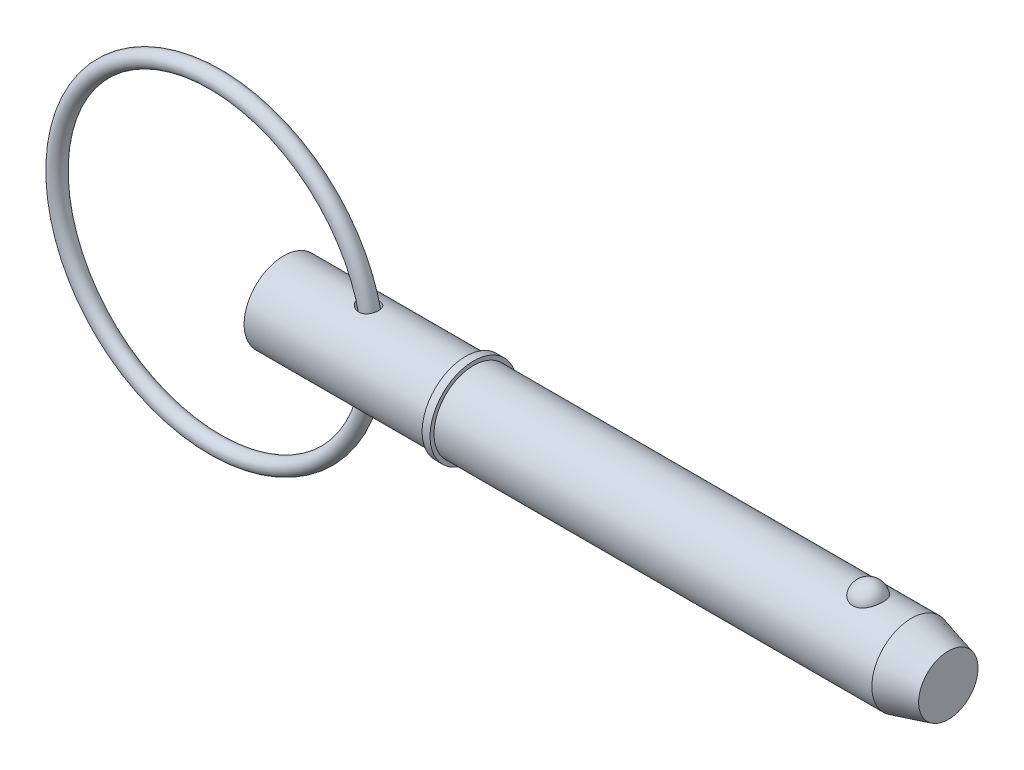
ISO-10303-21;
HEADER;
FILE_DESCRIPTION(('STEP AP214'),'2;1');
FILE_NAME('part.step','',(''),(''),'','','');
FILE_SCHEMA(('AUTOMOTIVE_DESIGN { 1 0 10303 214 1 1 1 1 }'));
ENDSEC;
DATA;
#1=APPLICATION_CONTEXT('core data for automotive mechanical design processes');
#2=APPLICATION_PROTOCOL_DEFINITION('international standard','automotive_design',2000,#1);
#3=PRODUCT_CONTEXT('',#1,'mechanical');
#4=PRODUCT('Part','Part','',(#3));
#5=PRODUCT_RELATED_PRODUCT_CATEGORY('part','',(#4));
#6=PRODUCT_DEFINITION_FORMATION('','',#4);
#7=PRODUCT_DEFINITION_CONTEXT('part definition',#1,'design');
#8=PRODUCT_DEFINITION('design','',#6,#7);
#9=PRODUCT_DEFINITION_SHAPE('','',#8);
#10=(LENGTH_UNIT() NAMED_UNIT(*) SI_UNIT(.MILLI.,.METRE.));
#11=(NAMED_UNIT(*) PLANE_ANGLE_UNIT() SI_UNIT($,.RADIAN.));
#12=(NAMED_UNIT(*) SI_UNIT($,.STERADIAN.) SOLID_ANGLE_UNIT());
#13=UNCERTAINTY_MEASURE_WITH_UNIT(LENGTH_MEASURE(1.E-05),#10,'distance_accuracy_value','');
#14=(GEOMETRIC_REPRESENTATION_CONTEXT(3) GLOBAL_UNCERTAINTY_ASSIGNED_CONTEXT((#13)) GLOBAL_UNIT_ASSIGNED_CONTEXT((#10,
#11,#12)) REPRESENTATION_CONTEXT('',''));
#15=CARTESIAN_POINT('',(0.,0.,0.));
#16=DIRECTION('',(0.,0.,1.));
#17=DIRECTION('',(1.,0.,0.));
#18=AXIS2_PLACEMENT_3D('',#15,#16,#17);
#19=CARTESIAN_POINT('',(-6.86864682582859,0.,0.));
#20=DIRECTION('',(0.,0.,1.));
#21=DIRECTION('',(1.,0.,0.));
#22=AXIS2_PLACEMENT_3D('',#19,#20,#21);
#23=TOROIDAL_SURFACE('',#22,15.875,0.794);
#24=CARTESIAN_POINT('',(9.80035317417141,0.,0.));
#25=VERTEX_POINT('',#24);
#26=VERTEX_LOOP('',#25);
#27=FACE_BOUND('',#26,.T.);
#28=ADVANCED_FACE('P0_F12',(#27),#23,.T.);
#29=CLOSED_SHELL('',(#28));
#30=MANIFOLD_SOLID_BREP('P0_B1',#29);
#31=CARTESIAN_POINT('',(0.,0.,0.));
#32=DIRECTION('',(1.,0.,0.));
#33=DIRECTION('',(0.,0.,-1.));
#34=AXIS2_PLACEMENT_3D('',#31,#32,#33);
#35=CYLINDRICAL_SURFACE('',#34,3.97);
#36=CARTESIAN_POINT('',(7.49679817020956,3.96502331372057,-0.198721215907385));
#37=CARTESIAN_POINT('',(7.50881508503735,3.96235594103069,-0.251916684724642));
#38=CARTESIAN_POINT('',(7.52561550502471,3.95866151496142,-0.304017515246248));
#39=CARTESIAN_POINT('',(7.56786984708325,3.9496659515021,-0.40447153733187));
#40=CARTESIAN_POINT('',(7.59333797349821,3.94436217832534,-0.452818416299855));
#41=CARTESIAN_POINT('',(7.65162192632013,3.93277091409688,-0.544364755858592));
#42=CARTESIAN_POINT('',(7.68440149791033,3.92648832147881,-0.587588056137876));
#43=CARTESIAN_POINT('',(7.75622109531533,3.91354812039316,-0.668369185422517));
#44=CARTESIAN_POINT('',(7.79526077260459,3.90689053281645,-0.705927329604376));
#45=CARTESIAN_POINT('',(7.88192852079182,3.8932854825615,-0.777603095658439));
#46=CARTESIAN_POINT('',(7.92999678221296,3.88635845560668,-0.811192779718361));
#47=CARTESIAN_POINT('',(8.03094744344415,3.87352417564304,-0.870420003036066));
#48=CARTESIAN_POINT('',(8.08383192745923,3.86761736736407,-0.896054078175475));
#49=CARTESIAN_POINT('',(8.19632733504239,3.85719062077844,-0.939958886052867));
#50=CARTESIAN_POINT('',(8.25615064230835,3.85277154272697,-0.957713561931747));
#51=CARTESIAN_POINT('',(8.37807849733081,3.84644428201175,-0.982821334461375));
#52=CARTESIAN_POINT('',(8.44018249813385,3.84453550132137,-0.990176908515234));
#53=CARTESIAN_POINT('',(8.56256649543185,3.84359535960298,-0.993820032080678));
#54=CARTESIAN_POINT('',(8.62283390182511,3.84446524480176,-0.990487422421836));
#55=CARTESIAN_POINT('',(8.74175397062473,3.84884648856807,-0.973323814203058));
#56=CARTESIAN_POINT('',(8.8004073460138,3.85235666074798,-0.959497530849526));
#57=CARTESIAN_POINT('',(8.91034168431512,3.86130428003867,-0.922798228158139));
#58=CARTESIAN_POINT('',(8.96185380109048,3.86659969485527,-0.900580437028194));
#59=CARTESIAN_POINT('',(9.06016940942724,3.87853590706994,-0.847697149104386));
#60=CARTESIAN_POINT('',(9.10697344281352,3.88517654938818,-0.817032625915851));
#61=CARTESIAN_POINT('',(9.19340982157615,3.89885483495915,-0.748999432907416));
#62=CARTESIAN_POINT('',(9.23319345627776,3.90587821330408,-0.711819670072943));
#63=CARTESIAN_POINT('',(9.30598310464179,3.91969783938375,-0.631295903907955));
#64=CARTESIAN_POINT('',(9.33898892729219,3.92649408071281,-0.587951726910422));
#65=CARTESIAN_POINT('',(9.39769437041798,3.939185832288,-0.495874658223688));
#66=CARTESIAN_POINT('',(9.42332322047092,3.94507238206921,-0.447095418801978));
#67=CARTESIAN_POINT('',(9.46625710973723,3.9552342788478,-0.345845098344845));
#68=CARTESIAN_POINT('',(9.48356178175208,3.95950955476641,-0.293373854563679));
#69=CARTESIAN_POINT('',(9.50956700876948,3.96602451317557,-0.185698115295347));
#70=CARTESIAN_POINT('',(9.51818595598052,3.96824487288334,-0.13047272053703));
#71=CARTESIAN_POINT('',(9.52633336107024,3.97034220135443,-0.0193113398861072));
#72=CARTESIAN_POINT('',(9.52586171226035,3.97021914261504,0.0366246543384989));
#73=CARTESIAN_POINT('',(9.51583327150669,3.9676413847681,0.147685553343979));
#74=CARTESIAN_POINT('',(9.50626624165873,3.96518405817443,0.202809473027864));
#75=CARTESIAN_POINT('',(9.47825604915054,3.95819854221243,0.310618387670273));
#76=CARTESIAN_POINT('',(9.45981267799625,3.95367030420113,0.36330332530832));
#77=CARTESIAN_POINT('',(9.41448405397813,3.94303435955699,0.464739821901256));
#78=CARTESIAN_POINT('',(9.38759833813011,3.93692656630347,0.51349116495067));
#79=CARTESIAN_POINT('',(9.32603556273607,3.92380455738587,0.605663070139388));
#80=CARTESIAN_POINT('',(9.29135869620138,3.91679036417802,0.649083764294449));
#81=CARTESIAN_POINT('',(9.21526329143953,3.90267522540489,0.729160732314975));
#82=CARTESIAN_POINT('',(9.17387556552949,3.89557480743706,0.765846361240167));
#83=CARTESIAN_POINT('',(9.08536362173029,3.88206315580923,0.831635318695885));
#84=CARTESIAN_POINT('',(9.03824022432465,3.8756518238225,0.860739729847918));
#85=CARTESIAN_POINT('',(8.94022154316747,3.86431915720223,0.910262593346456));
#86=CARTESIAN_POINT('',(8.88938101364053,3.85938013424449,0.930785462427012));
#87=CARTESIAN_POINT('',(8.78488780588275,3.85141510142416,0.96321476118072));
#88=CARTESIAN_POINT('',(8.73123520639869,3.84838903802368,0.975121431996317));
#89=CARTESIAN_POINT('',(8.62249427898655,3.84453017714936,0.990226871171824));
#90=CARTESIAN_POINT('',(8.56740225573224,3.84370373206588,0.993400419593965));
#91=CARTESIAN_POINT('',(8.45741104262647,3.8442816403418,0.991160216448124));
#92=CARTESIAN_POINT('',(8.40251189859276,3.84568649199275,0.98574454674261));
#93=CARTESIAN_POINT('',(8.29176880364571,3.85062289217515,0.966285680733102));
#94=CARTESIAN_POINT('',(8.23599684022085,3.85424894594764,0.951858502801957));
#95=CARTESIAN_POINT('',(8.12747212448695,3.86325492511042,0.91461785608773));
#96=CARTESIAN_POINT('',(8.0747205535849,3.86863553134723,0.891801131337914));
#97=CARTESIAN_POINT('',(7.97015235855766,3.88095261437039,0.836633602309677));
#98=CARTESIAN_POINT('',(7.91862083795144,3.88796764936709,0.803758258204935));
#99=CARTESIAN_POINT('',(7.82179253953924,3.90250904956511,0.729888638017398));
#100=CARTESIAN_POINT('',(7.77649765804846,3.91003556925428,0.688891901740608));
#101=CARTESIAN_POINT('',(7.69332536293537,3.92478114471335,0.599225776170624));
#102=CARTESIAN_POINT('',(7.6555122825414,3.93199714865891,0.550495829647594));
#103=CARTESIAN_POINT('',(7.5894819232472,3.94512912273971,0.446741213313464));
#104=CARTESIAN_POINT('',(7.56125849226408,3.95104592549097,0.391720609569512));
#105=CARTESIAN_POINT('',(7.51806227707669,3.9603062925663,0.282172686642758));
#106=CARTESIAN_POINT('',(7.50213211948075,3.96383230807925,0.228039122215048));
#107=CARTESIAN_POINT('',(7.48057398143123,3.96863642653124,0.117706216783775));
#108=CARTESIAN_POINT('',(7.47492746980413,3.96991857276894,0.0615107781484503));
#109=CARTESIAN_POINT('',(7.47437932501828,3.97004395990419,-0.0289758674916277));
#110=CARTESIAN_POINT('',(7.47615129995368,3.96964216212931,-0.0632805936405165));
#111=CARTESIAN_POINT('',(7.48358566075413,3.96796978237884,-0.131441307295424));
#112=CARTESIAN_POINT('',(7.48924767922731,3.96669928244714,-0.165297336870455));
#113=CARTESIAN_POINT('',(7.49679817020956,3.96502331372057,-0.198721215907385));
#114=B_SPLINE_CURVE_WITH_KNOTS('',3,(#36,#37,#38,#39,#40,#41,#42,#43,#44,#45,#46,#47,#48,#49,
#50,#51,#52,#53,#54,#55,#56,#57,#58,#59,#60,#61,#62,#63,#64,#65,#66,#67,#68,#69,#70,#71,#72,#73,
#74,#75,#76,#77,#78,#79,#80,#81,#82,#83,#84,#85,#86,#87,#88,#89,#90,#91,#92,#93,#94,#95,#96,#97,
#98,#99,#100,#101,#102,#103,#104,#105,#106,#107,#108,#109,#110,#111,#112,#113),.UNSPECIFIED.,
.T.,.F.,(4,2,2,2,2,2,2,2,2,2,2,2,2,2,2,2,2,2,2,2,2,2,2,2,2,2,2,2,2,2,2,2,2,2,2,2,2,2,4),(0.,
0.163661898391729,0.327593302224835,0.490729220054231,0.653856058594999,0.830244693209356,
1.00671002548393,1.1934572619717,1.38016000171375,1.56030212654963,1.74036335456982,
1.90857505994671,2.07676738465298,2.24071128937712,2.40465981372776,2.57013239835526,
2.73561228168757,2.90263284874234,3.06965537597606,3.23686612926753,3.40408081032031,
3.5713046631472,3.73852437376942,3.90499698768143,4.07144581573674,4.2358058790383,
4.40016134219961,4.56499094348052,4.72985735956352,4.90227873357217,5.0747670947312,
5.25849939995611,5.44228744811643,5.62759301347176,5.81277947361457,5.98144776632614,
6.14981181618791,6.25265388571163,6.35548624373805),.UNSPECIFIED.);
#115=CARTESIAN_POINT('',(7.49679817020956,3.96502331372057,-0.198721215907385));
#116=VERTEX_POINT('',#115);
#117=EDGE_CURVE('P1_E42',#116,#116,#114,.T.);
#118=ORIENTED_EDGE('',*,*,#117,.T.);
#119=EDGE_LOOP('',(#118));
#120=FACE_BOUND('',#119,.T.);
#121=CARTESIAN_POINT('',(0.,0.,0.));
#122=DIRECTION('',(1.,0.,0.));
#123=DIRECTION('',(0.,0.,-1.));
#124=AXIS2_PLACEMENT_3D('',#121,#122,#123);
#125=CIRCLE('',#124,3.97);
#126=CARTESIAN_POINT('',(0.,0.,-3.97));
#127=VERTEX_POINT('',#126);
#128=EDGE_CURVE('P1_E9',#127,#127,#125,.T.);
#129=ORIENTED_EDGE('',*,*,#128,.T.);
#130=EDGE_LOOP('',(#129));
#131=FACE_BOUND('',#130,.T.);
#132=CARTESIAN_POINT('',(18.256,0.,0.));
#133=DIRECTION('',(1.,0.,0.));
#134=DIRECTION('',(0.,0.,-1.));
#135=AXIS2_PLACEMENT_3D('',#132,#133,#134);
#136=CIRCLE('',#135,3.97);
#137=CARTESIAN_POINT('',(18.256,0.,-3.97));
#138=VERTEX_POINT('',#137);
#139=EDGE_CURVE('P1_E25',#138,#138,#136,.T.);
#140=ORIENTED_EDGE('',*,*,#139,.F.);
#141=EDGE_LOOP('',(#140));
#142=FACE_BOUND('',#141,.T.);
#143=CARTESIAN_POINT('',(7.49679817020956,-3.96502331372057,-0.198721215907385));
#144=CARTESIAN_POINT('',(7.48580986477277,-3.96746179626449,-0.150065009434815));
#145=CARTESIAN_POINT('',(7.47881617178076,-3.96904213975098,-0.100459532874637));
#146=CARTESIAN_POINT('',(7.47318383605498,-3.97031279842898,-0.000748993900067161));
#147=CARTESIAN_POINT('',(7.47454464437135,-3.97000323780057,0.049356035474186));
#148=CARTESIAN_POINT('',(7.48554252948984,-3.9675299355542,0.148550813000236));
#149=CARTESIAN_POINT('',(7.49517270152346,-3.9653677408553,0.197641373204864));
#150=CARTESIAN_POINT('',(7.5222068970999,-3.95942609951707,0.293523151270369));
#151=CARTESIAN_POINT('',(7.53961293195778,-3.9556462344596,0.340313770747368));
#152=CARTESIAN_POINT('',(7.58186218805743,-3.946757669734,0.431446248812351));
#153=CARTESIAN_POINT('',(7.6068526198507,-3.94162295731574,0.475716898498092));
#154=CARTESIAN_POINT('',(7.66318857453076,-3.93055115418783,0.559886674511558));
#155=CARTESIAN_POINT('',(7.69453617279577,-3.92461380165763,0.599784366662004));
#156=CARTESIAN_POINT('',(7.76618955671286,-3.91181958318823,0.678467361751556));
#157=CARTESIAN_POINT('',(7.80708710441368,-3.90493119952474,0.716708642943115));
#158=CARTESIAN_POINT('',(7.89431870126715,-3.89148185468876,0.786469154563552));
#159=CARTESIAN_POINT('',(7.94065563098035,-3.88492106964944,0.817984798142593));
#160=CARTESIAN_POINT('',(8.04208221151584,-3.87221514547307,0.876253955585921));
#161=CARTESIAN_POINT('',(8.09758465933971,-3.8661622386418,0.902312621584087));
#162=CARTESIAN_POINT('',(8.21228401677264,-3.855952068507,0.944996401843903));
#163=CARTESIAN_POINT('',(8.27148128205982,-3.85179498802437,0.961620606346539));
#164=CARTESIAN_POINT('',(8.39228716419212,-3.84593851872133,0.984786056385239));
#165=CARTESIAN_POINT('',(8.45390693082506,-3.84425231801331,0.991273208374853));
#166=CARTESIAN_POINT('',(8.57734686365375,-3.84370168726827,0.993408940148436));
#167=CARTESIAN_POINT('',(8.63916691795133,-3.84483588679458,0.989062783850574));
#168=CARTESIAN_POINT('',(8.75703619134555,-3.84970227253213,0.969937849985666));
#169=CARTESIAN_POINT('',(8.81320274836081,-3.85326512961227,0.955838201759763));
#170=CARTESIAN_POINT('',(8.92207486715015,-3.8624204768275,0.918140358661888));
#171=CARTESIAN_POINT('',(8.97478130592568,-3.86801245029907,0.89454458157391));
#172=CARTESIAN_POINT('',(9.07264210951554,-3.88024902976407,0.83982747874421));
#173=CARTESIAN_POINT('',(9.11803751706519,-3.88683023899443,0.809121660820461));
#174=CARTESIAN_POINT('',(9.20292513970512,-3.90048324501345,0.740506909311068));
#175=CARTESIAN_POINT('',(9.24241747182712,-3.90755503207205,0.702598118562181));
#176=CARTESIAN_POINT('',(9.31440361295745,-3.92139192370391,0.620727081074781));
#177=CARTESIAN_POINT('',(9.34691105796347,-3.9281576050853,0.576776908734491));
#178=CARTESIAN_POINT('',(9.40424150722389,-3.94066521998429,0.483990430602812));
#179=CARTESIAN_POINT('',(9.4290641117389,-3.94640710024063,0.435153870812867));
#180=CARTESIAN_POINT('',(9.47070060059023,-3.95631713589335,0.333318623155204));
#181=CARTESIAN_POINT('',(9.48741220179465,-3.96046506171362,0.280276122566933));
#182=CARTESIAN_POINT('',(9.51197570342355,-3.9666399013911,0.172058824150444));
#183=CARTESIAN_POINT('',(9.5198274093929,-3.96866676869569,0.116883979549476));
#184=CARTESIAN_POINT('',(9.52650209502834,-3.9703865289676,0.00572427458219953));
#185=CARTESIAN_POINT('',(9.52528754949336,-3.97006972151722,-0.0502629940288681));
#186=CARTESIAN_POINT('',(9.51376883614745,-3.96711300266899,-0.161232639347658));
#187=CARTESIAN_POINT('',(9.50346452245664,-3.96447305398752,-0.216214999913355));
#188=CARTESIAN_POINT('',(9.47400716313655,-3.95715440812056,-0.323616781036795));
#189=CARTESIAN_POINT('',(9.45485370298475,-3.95247561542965,-0.376036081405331));
#190=CARTESIAN_POINT('',(9.40815019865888,-3.94158766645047,-0.47682082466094));
#191=CARTESIAN_POINT('',(9.38060003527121,-3.93537848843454,-0.525186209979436));
#192=CARTESIAN_POINT('',(9.31780916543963,-3.92212278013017,-0.616423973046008));
#193=CARTESIAN_POINT('',(9.28257772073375,-3.91507726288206,-0.659302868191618));
#194=CARTESIAN_POINT('',(9.20530256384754,-3.90093459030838,-0.738394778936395));
#195=CARTESIAN_POINT('',(9.16325952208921,-3.8938374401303,-0.774608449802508));
#196=CARTESIAN_POINT('',(9.07394283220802,-3.88046830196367,-0.83901178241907));
#197=CARTESIAN_POINT('',(9.02672460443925,-3.87418889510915,-0.867276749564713));
#198=CARTESIAN_POINT('',(8.92806876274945,-3.86308015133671,-0.915492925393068));
#199=CARTESIAN_POINT('',(8.87663164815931,-3.85825064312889,-0.935445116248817));
#200=CARTESIAN_POINT('',(8.77150354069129,-3.85059630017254,-0.966469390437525));
#201=CARTESIAN_POINT('',(8.71783614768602,-3.84775433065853,-0.977617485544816));
#202=CARTESIAN_POINT('',(8.60934883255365,-3.84426767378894,-0.991239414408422));
#203=CARTESIAN_POINT('',(8.55452877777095,-3.84362324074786,-0.993712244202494));
#204=CARTESIAN_POINT('',(8.4438244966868,-3.84454392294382,-0.990144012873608));
#205=CARTESIAN_POINT('',(8.3879479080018,-3.84616465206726,-0.983888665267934));
#206=CARTESIAN_POINT('',(8.27791058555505,-3.85146784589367,-0.962917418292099));
#207=CARTESIAN_POINT('',(8.22375037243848,-3.85515092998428,-0.948198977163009));
#208=CARTESIAN_POINT('',(8.11503410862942,-3.86443542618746,-0.90964598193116));
#209=CARTESIAN_POINT('',(8.06067129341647,-3.87014379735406,-0.885291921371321));
#210=CARTESIAN_POINT('',(7.95661263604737,-3.88274545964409,-0.828274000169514));
#211=CARTESIAN_POINT('',(7.90691941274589,-3.88963940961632,-0.795605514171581));
#212=CARTESIAN_POINT('',(7.81143608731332,-3.90417480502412,-0.720990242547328));
#213=CARTESIAN_POINT('',(7.76592225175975,-3.9118359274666,-0.678692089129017));
#214=CARTESIAN_POINT('',(7.68309200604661,-3.926691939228,-0.586646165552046));
#215=CARTESIAN_POINT('',(7.6457689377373,-3.93388720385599,-0.536904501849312));
#216=CARTESIAN_POINT('',(7.58649683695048,-3.94577687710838,-0.440118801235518));
#217=CARTESIAN_POINT('',(7.56301593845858,-3.95068841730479,-0.394037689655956));
#218=CARTESIAN_POINT('',(7.52386335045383,-3.95904753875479,-0.298549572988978));
#219=CARTESIAN_POINT('',(7.5081856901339,-3.96249623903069,-0.249145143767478));
#220=CARTESIAN_POINT('',(7.49679817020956,-3.96502331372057,-0.198721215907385));
#221=B_SPLINE_CURVE_WITH_KNOTS('',3,(#143,#144,#145,#146,#147,#148,#149,#150,#151,#152,#153,
#154,#155,#156,#157,#158,#159,#160,#161,#162,#163,#164,#165,#166,#167,#168,#169,#170,#171,#172,
#173,#174,#175,#176,#177,#178,#179,#180,#181,#182,#183,#184,#185,#186,#187,#188,#189,#190,#191,
#192,#193,#194,#195,#196,#197,#198,#199,#200,#201,#202,#203,#204,#205,#206,#207,#208,#209,#210,
#211,#212,#213,#214,#215,#216,#217,#218,#219,#220),.UNSPECIFIED.,.T.,.F.,(4,2,2,2,2,2,2,2,2,2,2,
2,2,2,2,2,2,2,2,2,2,2,2,2,2,2,2,2,2,2,2,2,2,2,2,2,2,2,4),(0.,0.149644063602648,
0.299278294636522,0.448787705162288,0.598335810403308,0.750995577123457,0.903705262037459,
1.07224475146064,1.2408739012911,1.4248565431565,1.60885692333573,1.79383585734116,
1.97872492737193,2.15188813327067,2.32500727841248,2.489818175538,2.65462580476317,
2.81910871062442,2.98360017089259,3.15011526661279,3.31663401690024,3.48384236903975,
3.65105340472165,3.81827227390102,3.98549351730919,4.15251423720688,4.31951852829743,
4.48488279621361,4.65022752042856,4.81412860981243,4.97804866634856,5.14606470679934,
5.31413123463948,5.49286956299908,5.67170754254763,5.85859317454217,6.0453263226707,
6.20052601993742,6.35560677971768),.UNSPECIFIED.);
#222=CARTESIAN_POINT('',(7.49679817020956,-3.96502331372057,-0.198721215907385));
#223=VERTEX_POINT('',#222);
#224=EDGE_CURVE('P1_E17',#223,#223,#221,.T.);
#225=ORIENTED_EDGE('',*,*,#224,.T.);
#226=EDGE_LOOP('',(#225));
#227=FACE_BOUND('',#226,.T.);
#228=ADVANCED_FACE('P1_F13',(#120,#131,#142,#227),#35,.T.);
#229=CARTESIAN_POINT('',(0.,0.,0.));
#230=DIRECTION('',(1.,0.,0.));
#231=DIRECTION('',(0.,0.,-1.));
#232=AXIS2_PLACEMENT_3D('',#229,#230,#231);
#233=CYLINDRICAL_SURFACE('',#232,3.97);
#234=CARTESIAN_POINT('',(62.9759395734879,0.,0.));
#235=DIRECTION('',(1.,0.,0.));
#236=DIRECTION('',(0.,0.,-1.));
#237=AXIS2_PLACEMENT_3D('',#234,#235,#236);
#238=CIRCLE('',#237,3.97);
#239=CARTESIAN_POINT('',(62.9759395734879,0.,-3.97));
#240=VERTEX_POINT('',#239);
#241=EDGE_CURVE('P1_E99',#240,#240,#238,.T.);
#242=ORIENTED_EDGE('',*,*,#241,.F.);
#243=EDGE_LOOP('',(#242));
#244=FACE_BOUND('',#243,.T.);
#245=CARTESIAN_POINT('',(19.05,0.,0.));
#246=DIRECTION('',(1.,0.,0.));
#247=DIRECTION('',(0.,0.,-1.));
#248=AXIS2_PLACEMENT_3D('',#245,#246,#247);
#249=CIRCLE('',#248,3.97);
#250=CARTESIAN_POINT('',(19.05,0.,-3.97));
#251=VERTEX_POINT('',#250);
#252=EDGE_CURVE('P1_E96',#251,#251,#249,.T.);
#253=ORIENTED_EDGE('',*,*,#252,.T.);
#254=EDGE_LOOP('',(#253));
#255=FACE_BOUND('',#254,.T.);
#256=CARTESIAN_POINT('',(58.6451922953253,3.65715365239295,1.5447094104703));
#257=CARTESIAN_POINT('',(58.5652448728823,3.65716001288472,1.54470290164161));
#258=CARTESIAN_POINT('',(58.4851650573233,3.65987074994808,1.53832549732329));
#259=CARTESIAN_POINT('',(58.3272374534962,3.6704221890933,1.51297018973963));
#260=CARTESIAN_POINT('',(58.2493961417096,3.67827646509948,1.49395894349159));
#261=CARTESIAN_POINT('',(58.0984614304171,3.69818848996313,1.4439595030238));
#262=CARTESIAN_POINT('',(58.0253560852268,3.71023513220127,1.41300293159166));
#263=CARTESIAN_POINT('',(57.8855630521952,3.7372183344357,1.34000212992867));
#264=CARTESIAN_POINT('',(57.8188725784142,3.75215363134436,1.29796274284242));
#265=CARTESIAN_POINT('',(57.69148864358,3.78384968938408,1.20248834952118));
#266=CARTESIAN_POINT('',(57.6310299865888,3.800651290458,1.14875388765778));
#267=CARTESIAN_POINT('',(57.5196942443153,3.83398532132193,1.03205417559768));
#268=CARTESIAN_POINT('',(57.4688200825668,3.85051766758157,0.96908611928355));
#269=CARTESIAN_POINT('',(57.3756321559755,3.88238608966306,0.832526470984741));
#270=CARTESIAN_POINT('',(57.3337961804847,3.89763698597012,0.758588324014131));
#271=CARTESIAN_POINT('',(57.2625108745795,3.92451063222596,0.604352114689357));
#272=CARTESIAN_POINT('',(57.2330623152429,3.93613315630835,0.524053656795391));
#273=CARTESIAN_POINT('',(57.1868927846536,3.95467606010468,0.358403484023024));
#274=CARTESIAN_POINT('',(57.1703127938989,3.96154426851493,0.273006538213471));
#275=CARTESIAN_POINT('',(57.150756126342,3.96967008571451,0.100408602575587));
#276=CARTESIAN_POINT('',(57.1477789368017,3.97092790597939,0.0132076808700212));
#277=CARTESIAN_POINT('',(57.1554587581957,3.96771794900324,-0.15984454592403));
#278=CARTESIAN_POINT('',(57.1660164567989,3.96329187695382,-0.245701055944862));
#279=CARTESIAN_POINT('',(57.2003800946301,3.94923163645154,-0.414277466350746));
#280=CARTESIAN_POINT('',(57.2241862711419,3.93959737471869,-0.49699731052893));
#281=CARTESIAN_POINT('',(57.2846114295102,3.91607752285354,-0.657113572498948));
#282=CARTESIAN_POINT('',(57.3212495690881,3.90218558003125,-0.734501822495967));
#283=CARTESIAN_POINT('',(57.4065935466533,3.87158287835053,-0.881704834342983));
#284=CARTESIAN_POINT('',(57.4553004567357,3.8548718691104,-0.951518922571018));
#285=CARTESIAN_POINT('',(57.5641161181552,3.82028735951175,-1.08208159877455));
#286=CARTESIAN_POINT('',(57.6242955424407,3.80240713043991,-1.14276958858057));
#287=CARTESIAN_POINT('',(57.754493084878,3.76758161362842,-1.25282437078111));
#288=CARTESIAN_POINT('',(57.8245105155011,3.75063626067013,-1.30219195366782));
#289=CARTESIAN_POINT('',(57.97118160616,3.71998948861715,-1.38729709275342));
#290=CARTESIAN_POINT('',(58.0476813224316,3.70623183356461,-1.42327904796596));
#291=CARTESIAN_POINT('',(58.2062981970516,3.68323188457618,-1.48178996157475));
#292=CARTESIAN_POINT('',(58.2884132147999,3.67398788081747,-1.50432401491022));
#293=CARTESIAN_POINT('',(58.4514810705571,3.6615216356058,-1.53440939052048));
#294=CARTESIAN_POINT('',(58.5322840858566,3.65801951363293,-1.54265826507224));
#295=CARTESIAN_POINT('',(58.6942085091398,3.65657341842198,-1.54608423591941));
#296=CARTESIAN_POINT('',(58.7753298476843,3.65862829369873,-1.5412640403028));
#297=CARTESIAN_POINT('',(58.9328122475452,3.66788969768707,-1.51908474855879));
#298=CARTESIAN_POINT('',(59.0092422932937,3.67492621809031,-1.50213925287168));
#299=CARTESIAN_POINT('',(59.1580412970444,3.69318404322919,-1.4566698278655));
#300=CARTESIAN_POINT('',(59.2304099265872,3.7044056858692,-1.42814496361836));
#301=CARTESIAN_POINT('',(59.3708029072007,3.73012749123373,-1.35956319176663));
#302=CARTESIAN_POINT('',(59.4387000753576,3.74469307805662,-1.31927107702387));
#303=CARTESIAN_POINT('',(59.5668649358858,3.77545272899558,-1.22847440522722));
#304=CARTESIAN_POINT('',(59.6271308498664,3.79164717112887,-1.17796747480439));
#305=CARTESIAN_POINT('',(59.7416346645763,3.82490325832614,-1.0651926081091));
#306=CARTESIAN_POINT('',(59.7954137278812,3.84196735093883,-1.0024591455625));
#307=CARTESIAN_POINT('',(59.8920988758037,3.87439863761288,-0.868715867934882));
#308=CARTESIAN_POINT('',(59.9350030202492,3.88976552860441,-0.797704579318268));
#309=CARTESIAN_POINT('',(60.010266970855,3.91771381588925,-0.646896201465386));
#310=CARTESIAN_POINT('',(60.0422532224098,3.93019255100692,-0.566893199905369));
#311=CARTESIAN_POINT('',(60.0931101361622,3.95043886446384,-0.4022551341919));
#312=CARTESIAN_POINT('',(60.1119807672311,3.95820643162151,-0.317620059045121));
#313=CARTESIAN_POINT('',(60.1362162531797,3.96823733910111,-0.146156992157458));
#314=CARTESIAN_POINT('',(60.1415874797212,3.97050327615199,-0.0593300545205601));
#315=CARTESIAN_POINT('',(60.138730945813,3.96930811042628,0.114057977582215));
#316=CARTESIAN_POINT('',(60.1305035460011,3.9658471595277,0.200619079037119));
#317=CARTESIAN_POINT('',(60.1007063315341,3.95358562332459,0.370506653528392));
#318=CARTESIAN_POINT('',(60.0792129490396,3.94481563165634,0.45384877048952));
#319=CARTESIAN_POINT('',(60.0233839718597,3.92284586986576,0.615497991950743));
#320=CARTESIAN_POINT('',(59.9890474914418,3.90964579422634,0.693804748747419));
#321=CARTESIAN_POINT('',(59.9079702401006,3.88006987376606,0.843703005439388));
#322=CARTESIAN_POINT('',(59.8611536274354,3.86367478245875,0.915249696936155));
#323=CARTESIAN_POINT('',(59.7561897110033,3.82949741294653,1.04910810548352));
#324=CARTESIAN_POINT('',(59.6980428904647,3.81171519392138,1.1114202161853));
#325=CARTESIAN_POINT('',(59.5717433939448,3.77673366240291,1.22503948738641));
#326=CARTESIAN_POINT('',(59.5035970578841,3.75953398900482,1.27635357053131));
#327=CARTESIAN_POINT('',(59.3589009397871,3.72770506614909,1.36653336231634));
#328=CARTESIAN_POINT('',(59.282348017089,3.7130767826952,1.40539439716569));
#329=CARTESIAN_POINT('',(59.1257594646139,3.68864287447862,1.46830480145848));
#330=CARTESIAN_POINT('',(59.0459307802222,3.67869017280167,1.49281289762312));
#331=CARTESIAN_POINT('',(58.8829877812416,3.66414535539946,1.52817474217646));
#332=CARTESIAN_POINT('',(58.7998840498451,3.65953723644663,1.53906926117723));
#333=CARTESIAN_POINT('',(58.6927760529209,3.6573894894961,1.54414878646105));
#334=CARTESIAN_POINT('',(58.6689900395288,3.65715175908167,1.54471134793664));
#335=CARTESIAN_POINT('',(58.6451922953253,3.65715365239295,1.5447094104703));
#336=B_SPLINE_CURVE_WITH_KNOTS('',3,(#256,#257,#258,#259,#260,#261,#262,#263,#264,#265,#266,
#267,#268,#269,#270,#271,#272,#273,#274,#275,#276,#277,#278,#279,#280,#281,#282,#283,#284,#285,
#286,#287,#288,#289,#290,#291,#292,#293,#294,#295,#296,#297,#298,#299,#300,#301,#302,#303,#304,
#305,#306,#307,#308,#309,#310,#311,#312,#313,#314,#315,#316,#317,#318,#319,#320,#321,#322,#323,
#324,#325,#326,#327,#328,#329,#330,#331,#332,#333,#334,#335),.UNSPECIFIED.,.T.,.F.,(4,2,2,2,2,2,
2,2,2,2,2,2,2,2,2,2,2,2,2,2,2,2,2,2,2,2,2,2,2,2,2,2,2,2,2,2,2,2,2,4),(0.,0.239777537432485,
0.480190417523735,0.719971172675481,0.959647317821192,1.20639040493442,1.45320863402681,
1.71093679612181,1.9686809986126,2.22921052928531,2.48973023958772,2.74834928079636,
3.00697295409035,3.26598440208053,3.52501886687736,3.78570385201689,4.04637062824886,
4.30201257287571,4.55755760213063,4.80022994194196,5.04285200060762,5.27757006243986,
5.51230707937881,5.75210128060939,5.99195126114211,6.24392810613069,6.49594987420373,
6.7558881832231,7.01582710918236,7.27564332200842,7.53545264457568,7.79377886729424,
8.05212290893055,8.3120741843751,8.57201437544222,8.83179046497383,9.09166393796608,
9.34270057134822,9.59298357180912,9.66435753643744),.UNSPECIFIED.);
#337=CARTESIAN_POINT('',(58.6451922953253,3.65715365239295,1.5447094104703));
#338=VERTEX_POINT('',#337);
#339=EDGE_CURVE('P1_E34',#338,#338,#336,.T.);
#340=ORIENTED_EDGE('',*,*,#339,.T.);
#341=EDGE_LOOP('',(#340));
#342=FACE_BOUND('',#341,.T.);
#343=ADVANCED_FACE('P1_F46',(#244,#255,#342),#233,.T.);
#344=CARTESIAN_POINT('',(0.,0.,0.));
#345=DIRECTION('',(-1.,0.,0.));
#346=DIRECTION('',(0.,0.,1.));
#347=AXIS2_PLACEMENT_3D('',#344,#345,#346);
#348=PLANE('',#347);
#349=ORIENTED_EDGE('',*,*,#128,.F.);
#350=EDGE_LOOP('',(#349));
#351=FACE_BOUND('',#350,.T.);
#352=ADVANCED_FACE('P1_F15',(#351),#348,.T.);
#353=CARTESIAN_POINT('',(18.256,3.97,0.));
#354=DIRECTION('',(-1.,0.,0.));
#355=DIRECTION('',(0.,0.,1.));
#356=AXIS2_PLACEMENT_3D('',#353,#354,#355);
#357=PLANE('',#356);
#358=ORIENTED_EDGE('',*,*,#139,.T.);
#359=EDGE_LOOP('',(#358));
#360=FACE_BOUND('',#359,.T.);
#361=CARTESIAN_POINT('',(18.256,0.,0.));
#362=DIRECTION('',(1.,0.,0.));
#363=DIRECTION('',(0.,0.,-1.));
#364=AXIS2_PLACEMENT_3D('',#361,#362,#363);
#365=CIRCLE('',#364,4.367);
#366=CARTESIAN_POINT('',(18.256,0.,-4.367));
#367=VERTEX_POINT('',#366);
#368=EDGE_CURVE('P1_E30',#367,#367,#365,.T.);
#369=ORIENTED_EDGE('',*,*,#368,.F.);
#370=EDGE_LOOP('',(#369));
#371=FACE_BOUND('',#370,.T.);
#372=ADVANCED_FACE('P1_F81',(#360,#371),#357,.T.);
#373=CARTESIAN_POINT('',(0.,0.,0.));
#374=DIRECTION('',(1.,0.,0.));
#375=DIRECTION('',(0.,0.,-1.));
#376=AXIS2_PLACEMENT_3D('',#373,#374,#375);
#377=CYLINDRICAL_SURFACE('',#376,4.367);
#378=ORIENTED_EDGE('',*,*,#368,.T.);
#379=EDGE_LOOP('',(#378));
#380=FACE_BOUND('',#379,.T.);
#381=CARTESIAN_POINT('',(19.05,0.,0.));
#382=DIRECTION('',(1.,0.,0.));
#383=DIRECTION('',(0.,0.,-1.));
#384=AXIS2_PLACEMENT_3D('',#381,#382,#383);
#385=CIRCLE('',#384,4.367);
#386=CARTESIAN_POINT('',(19.05,0.,-4.367));
#387=VERTEX_POINT('',#386);
#388=EDGE_CURVE('P1_E95',#387,#387,#385,.T.);
#389=ORIENTED_EDGE('',*,*,#388,.F.);
#390=EDGE_LOOP('',(#389));
#391=FACE_BOUND('',#390,.T.);
#392=ADVANCED_FACE('P1_F68',(#380,#391),#377,.T.);
#393=CARTESIAN_POINT('',(19.05,4.367,0.));
#394=DIRECTION('',(1.,0.,0.));
#395=DIRECTION('',(0.,0.,-1.));
#396=AXIS2_PLACEMENT_3D('',#393,#394,#395);
#397=PLANE('',#396);
#398=ORIENTED_EDGE('',*,*,#388,.T.);
#399=EDGE_LOOP('',(#398));
#400=FACE_BOUND('',#399,.T.);
#401=ORIENTED_EDGE('',*,*,#252,.F.);
#402=EDGE_LOOP('',(#401));
#403=FACE_BOUND('',#402,.T.);
#404=ADVANCED_FACE('P1_F62',(#400,#403),#397,.T.);
#405=CARTESIAN_POINT('',(66.68,0.,0.));
#406=DIRECTION('',(-1.,0.,0.));
#407=DIRECTION('',(0.,0.,1.));
#408=AXIS2_PLACEMENT_3D('',#405,#406,#407);
#409=CONICAL_SURFACE('',#408,2.97750000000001,0.26179938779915);
#410=ORIENTED_EDGE('',*,*,#241,.T.);
#411=EDGE_LOOP('',(#410));
#412=FACE_BOUND('',#411,.T.);
#413=CARTESIAN_POINT('',(66.68,0.,0.));
#414=DIRECTION('',(1.,0.,0.));
#415=DIRECTION('',(0.,0.,-1.));
#416=AXIS2_PLACEMENT_3D('',#413,#414,#415);
#417=CIRCLE('',#416,2.97750000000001);
#418=CARTESIAN_POINT('',(66.68,0.,-2.97750000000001));
#419=VERTEX_POINT('',#418);
#420=EDGE_CURVE('P1_E41',#419,#419,#417,.T.);
#421=ORIENTED_EDGE('',*,*,#420,.F.);
#422=EDGE_LOOP('',(#421));
#423=FACE_BOUND('',#422,.T.);
#424=ADVANCED_FACE('P1_F59',(#412,#423),#409,.T.);
#425=CARTESIAN_POINT('',(66.68,2.97750000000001,0.));
#426=DIRECTION('',(1.,0.,0.));
#427=DIRECTION('',(0.,0.,-1.));
#428=AXIS2_PLACEMENT_3D('',#425,#426,#427);
#429=PLANE('',#428);
#430=ORIENTED_EDGE('',*,*,#420,.T.);
#431=EDGE_LOOP('',(#430));
#432=FACE_BOUND('',#431,.T.);
#433=ADVANCED_FACE('P1_F55',(#432),#429,.T.);
#434=CARTESIAN_POINT('',(58.6451922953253,3.57299999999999,0.));
#435=DIRECTION('',(-1.,0.,0.));
#436=DIRECTION('',(0.,1.,0.));
#437=AXIS2_PLACEMENT_3D('',#434,#435,#436);
#438=SPHERICAL_SURFACE('',#437,1.54700000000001);
#439=ORIENTED_EDGE('',*,*,#339,.F.);
#440=EDGE_LOOP('',(#439));
#441=FACE_BOUND('',#440,.T.);
#442=ADVANCED_FACE('P1_F50',(#441),#438,.T.);
#443=CARTESIAN_POINT('',(-6.86864682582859,0.,0.));
#444=DIRECTION('',(0.,0.,1.));
#445=DIRECTION('',(1.,0.,0.));
#446=AXIS2_PLACEMENT_3D('',#443,#444,#445);
#447=TOROIDAL_SURFACE('',#446,15.875,0.992500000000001);
#448=ORIENTED_EDGE('',*,*,#224,.F.);
#449=EDGE_LOOP('',(#448));
#450=FACE_BOUND('',#449,.T.);
#451=ORIENTED_EDGE('',*,*,#117,.F.);
#452=EDGE_LOOP('',(#451));
#453=FACE_BOUND('',#452,.T.);
#454=ADVANCED_FACE('P1_F54',(#450,#453),#447,.F.);
#455=CLOSED_SHELL('',(#228,#343,#352,#372,#392,#404,#424,#433,#442,#454));
#456=MANIFOLD_SOLID_BREP('P1_B1',#455);
#457=ADVANCED_BREP_SHAPE_REPRESENTATION('',(#18,#30,#456),#14);
#458=SHAPE_DEFINITION_REPRESENTATION(#9,#457);
ENDSEC;
END-ISO-10303-21;
